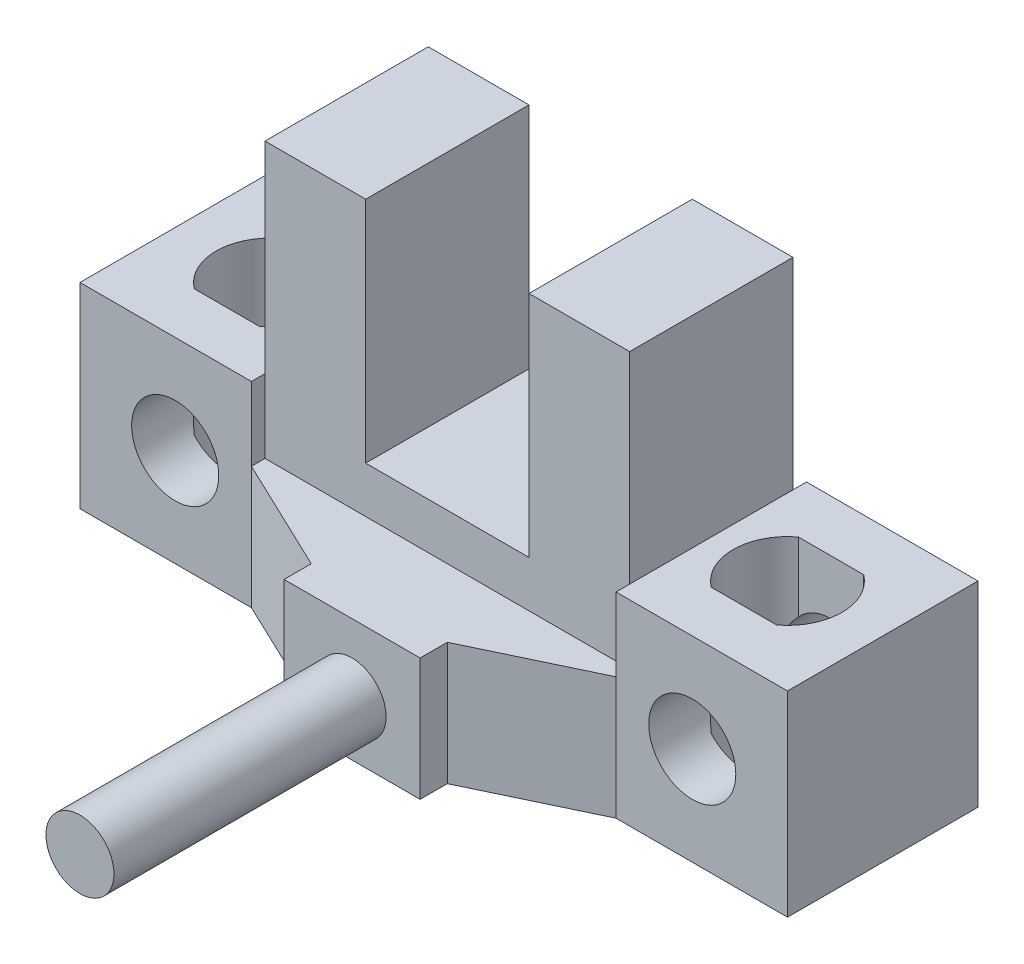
from build123d import *

# Parameters (mm, degrees)
EXTRUDE_1_DEPTH     = 7
CUT_EXTRUDE_1_DEPTH = 0.5
CUT_EXTRUDE_2_DEPTH = 0.5
EXTRUDE_3_DEPTH     = 4.5
SKETCH_5_R          = 1.6
CUT_EXTRUDE_3_DEPTH = 7
SKETCH_6_R          = 1.6
CUT_EXTRUDE_4_DEPTH = 7
CUT_EXTRUDE_6_DEPTH = 7.2
CUT_EXTRUDE_7_DEPTH = 7.2
SKETCH_9_R          = 1.25
EXTRUDE_4_DEPTH     = 10


with BuildPart() as part:
    # Sketch 1 → Extrude 1 (new body)
    with BuildSketch(Plane.XY):
        Polygon((0, 0), (0, 7.2), (6.3, 7.2), (6.3, 14.6), (10, 14.6), (10, 6.2), (16, 6.2), (16, 14.6), (19.7, 14.6), (19.7, 7.2), (26, 7.2), (26, 0), align=None)
    extrude(amount=EXTRUDE_1_DEPTH)

    # Sketch 2 → Cut-Extrude 1 (cut)
    with BuildSketch(Plane.XY.offset(7)):
        Polygon((6.3, 7.2), (6.3, 14.6), (10, 14.6), (10, 6.2), (16, 6.2), (16, 14.6), (19.7, 14.6), (19.7, 0), (6.3, 0), align=None)
    extrude(amount=-CUT_EXTRUDE_1_DEPTH, mode=Mode.SUBTRACT)

    # Sketch 3 → Cut-Extrude 2 (cut)
    with BuildSketch(Plane(origin=(0, 0, 0), x_dir=(-1, 0, 0), z_dir=(0, 0, -1))):
        Polygon((-19.7, 7.2), (-19.7, 14.6), (-16, 14.6), (-16, 6.2), (-10, 6.2), (-10, 14.6), (-6.3, 14.6), (-6.3, 0), (-19.7, 0), align=None)
    extrude(amount=-CUT_EXTRUDE_2_DEPTH, mode=Mode.SUBTRACT)

    # Sketch 4 → Extrude 3 (add)
    with BuildSketch(Plane.XZ):
        Polygon((6.3, 7), (6.3, 6.5), (19.7, 6.5), (19.7, 7), (15.5, 9), (15.5, 10), (10.5, 10), (10.5, 9), align=None)
    extrude(amount=-EXTRUDE_3_DEPTH)

    # Sketch 5 → Cut-Extrude 3 (cut)
    with BuildSketch(Plane.XY.offset(7)):
        with Locations((3.5, 3.6)):
            Circle(SKETCH_5_R)
    extrude(amount=-CUT_EXTRUDE_3_DEPTH, mode=Mode.SUBTRACT)

    # Sketch 6 → Cut-Extrude 4 (cut)
    with BuildSketch(Plane.XY.offset(7)):
        with Locations((22.5, 3.6)):
            Circle(SKETCH_6_R)
    extrude(amount=-CUT_EXTRUDE_4_DEPTH, mode=Mode.SUBTRACT)

    # Sketch 7 → Cut-Extrude 6 (cut)
    with BuildSketch(Plane(origin=(0, 7.2, 0), x_dir=(1, 0, 0), z_dir=(0, 1, 0))):
        with BuildLine():
            Line((3.5, -1.9), (4.7, -1.9))
            ThreePointArc((4.7, -1.9), (5.5, -3.5), (4.7, -5.1))
            Line((4.7, -5.1), (2.3, -5.1))
            ThreePointArc((2.3, -5.1), (1.5, -3.5), (2.3, -1.9))
            Line((2.3, -1.9), (3.5, -1.9))
        make_face()
    extrude(amount=-CUT_EXTRUDE_6_DEPTH, mode=Mode.SUBTRACT)

    # Sketch 8 → Cut-Extrude 7 (cut)
    with BuildSketch(Plane(origin=(0, 7.2, 0), x_dir=(1, 0, 0), z_dir=(0, 1, 0))):
        with BuildLine():
            Line((22.5, -1.9), (23.7, -1.9))
            ThreePointArc((23.7, -1.9), (24.5, -3.5), (23.7, -5.1))
            Line((23.7, -5.1), (21.3, -5.1))
            ThreePointArc((21.3, -5.1), (20.5, -3.5), (21.3, -1.9))
            Line((21.3, -1.9), (22.5, -1.9))
        make_face()
    extrude(amount=-CUT_EXTRUDE_7_DEPTH, mode=Mode.SUBTRACT)

    # Sketch 9 → Extrude 4 (add)
    with BuildSketch(Plane.XY.offset(10)):
        with Locations((13, 2)):
            Circle(SKETCH_9_R)
    extrude(amount=EXTRUDE_4_DEPTH)


solid = part.part
